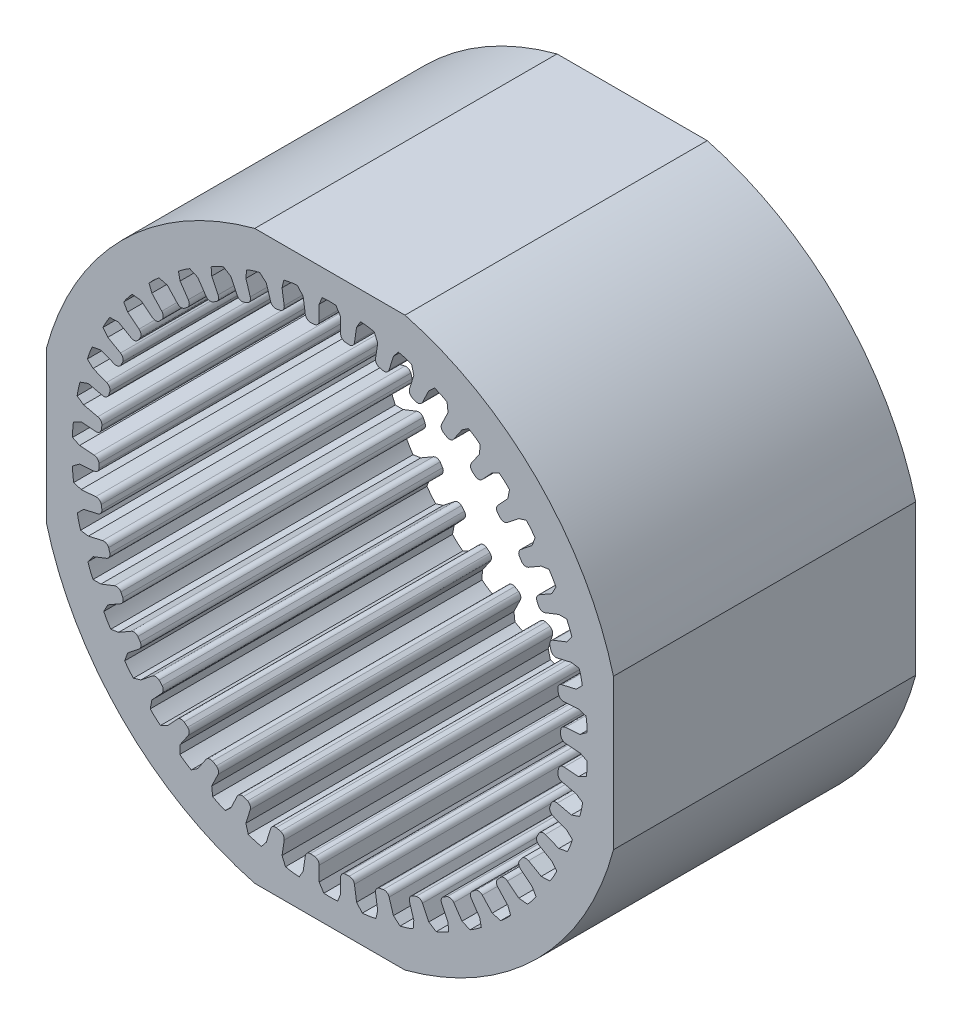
from build123d import *

# Parameters (mm, degrees)
EXTRUSION1_DEPTH        = 17
ENL_V_MAT_EXTRU_2_DEPTH = 29.24544211


with BuildPart() as part:
    # Esquisse2 → Extrusion1 (new body)
    with BuildSketch(Plane.XY):
        with BuildLine():
            Line((15.95, 4.224630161), (15.95, -4.224630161))
            ThreePointArc((15.95, -4.224630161), (11.66726189, -11.66726189), (4.224630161, -15.95))
            Line((4.224630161, -15.95), (-4.224630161, -15.95))
            ThreePointArc((-4.224630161, -15.95), (-11.66726189, -11.66726189), (-15.95, -4.224630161))
            Line((-15.95, -4.224630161), (-15.95, 4.224630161))
            ThreePointArc((-15.95, 4.224630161), (-11.66726189, 11.66726189), (-4.224630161, 15.95))
            Line((-4.224630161, 15.95), (4.224630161, 15.95))
            ThreePointArc((4.224630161, 15.95), (11.66726189, 11.66726189), (15.95, 4.224630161))
        make_face()
    extrude(amount=EXTRUSION1_DEPTH)

    # Esquisse3 → Enl_v. mat.-Extru.2 (cut, through all)
    with BuildSketch(Plane.XY.offset(17)):
        with BuildLine():
            Line((-0.437557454, 14.47958796), (-0.6, 14.07104085))
            Line((-0.6, 14.07104085), (-0.6, 13.24999998))
            ThreePointArc((-0.6, 13.24999998), (-0.66832193, 13.059408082), (-0.842168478, 12.955626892))
            Line((-0.842168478, 12.955626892), (-1.094516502, 12.939148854))
            ThreePointArc((-1.094516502, 12.939148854), (-1.28437559, 13.014582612), (-1.381912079, 13.19409127))
            Line((-1.381912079, 13.19409127), (-1.503883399, 14.003318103))
            Line((-1.503883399, 14.003318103), (-1.824603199, 14.376426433))
            ThreePointArc((-1.824603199, 14.376426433), (-2.210231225, 14.33037769), (-2.590740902, 14.252648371))
            Line((-2.590740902, 14.252648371), (-2.690478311, 13.82445359))
            Line((-2.690478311, 13.82445359), (-2.56810852, 13.012583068))
            ThreePointArc((-2.56810852, 13.012583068), (-2.607261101, 12.813937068), (-2.763698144, 12.685404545))
            Line((-2.763698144, 12.685404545), (-3.010771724, 12.631500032))
            ThreePointArc((-3.010771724, 12.631500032), (-3.209753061, 12.677794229), (-3.332954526, 12.840760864))
            Line((-3.332954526, 12.840760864), (-3.574172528, 13.62277042))
            Line((-3.574172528, 13.62277042), (-3.946919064, 13.943910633))
            ThreePointArc((-3.946919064, 13.943910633), (-4.321376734, 13.840901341), (-4.686051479, 13.70732817))
            Line((-4.686051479, 13.70732817), (-4.720855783, 13.269050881))
            Line((-4.720855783, 13.269050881), (-4.478849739, 12.484486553))
            ThreePointArc((-4.478849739, 12.484486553), (-4.487958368, 12.282223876), (-4.62349136, 12.131811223))
            Line((-4.62349136, 12.131811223), (-4.859771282, 12.041684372))
            ThreePointArc((-4.859771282, 12.041684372), (-5.063429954, 12.057804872), (-5.209544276, 12.200589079))
            Line((-5.209544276, 12.200589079), (-5.564620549, 12.937912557))
            Line((-5.564620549, 12.937912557), (-5.981067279, 13.19991091))
            ThreePointArc((-5.981067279, 13.19991091), (-6.335989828, 13.042242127), (-6.676683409, 12.855808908))
            Line((-6.676683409, 12.855808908), (-6.645777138, 12.417239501))
            Line((-6.645777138, 12.417239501), (-6.289540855, 11.677507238))
            ThreePointArc((-6.289540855, 11.677507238), (-6.268402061, 11.476146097), (-6.380003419, 11.307213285))
            Line((-6.380003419, 11.307213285), (-6.600211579, 11.182877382))
            ThreePointArc((-6.600211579, 11.182877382), (-6.803998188, 11.168464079), (-6.969761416, 11.287876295))
            Line((-6.969761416, 11.287876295), (-7.430764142, 11.964043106))
            Line((-7.430764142, 11.964043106), (-7.881608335, 12.16104699))
            ThreePointArc((-7.881608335, 12.16104699), (-8.20906738, 11.952240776), (-8.518169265, 11.717112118))
            Line((-8.518169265, 11.717112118), (-8.422242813, 11.28804751))
            Line((-8.422242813, 11.28804751), (-7.959734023, 10.609671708))
            ThreePointArc((-7.959734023, 10.609671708), (-7.908820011, 10.413710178), (-7.993996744, 10.230030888))
            Line((-7.993996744, 10.230030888), (-8.193214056, 10.07426339))
            ThreePointArc((-8.193214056, 10.07426339), (-8.392576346, 10.029638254), (-8.574285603, 10.123011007))
            Line((-8.574285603, 10.123011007), (-9.130916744, 10.722916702))
            Line((-9.130916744, 10.722916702), (-9.606087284, 10.850525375))
            ThreePointArc((-9.606087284, 10.850525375), (-9.898767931, 10.595246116), (-10.169373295, 10.316674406))
            Line((-10.169373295, 10.316674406), (-10.010569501, 9.906699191))
            Line((-10.010569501, 9.906699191), (-9.452119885, 9.304833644))
            ThreePointArc((-9.452119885, 9.304833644), (-9.37256799, 9.118649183), (-9.429417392, 8.924326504))
            Line((-9.429417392, 8.924326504), (-9.603193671, 8.740607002))
            ThreePointArc((-9.603193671, 8.740607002), (-9.793678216, 8.666766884), (-9.987274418, 8.73201438))
            Line((-9.987274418, 8.73201438), (-10.627099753, 9.242258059))
            Line((-10.627099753, 9.242258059), (-11.115982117, 9.297620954))
            ThreePointArc((-11.115982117, 9.297620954), (-11.367346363, 9.001571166), (-11.593410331, 8.685779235))
            Line((-11.593410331, 8.685779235), (-11.375276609, 8.304051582))
            Line((-11.375276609, 8.304051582), (-10.733361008, 7.792140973))
            ThreePointArc((-10.733361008, 7.792140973), (-10.626948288, 7.619892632), (-10.654200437, 7.419267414))
            Line((-10.654200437, 7.419267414), (-10.798653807, 7.211699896))
            ThreePointArc((-10.798653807, 7.211699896), (-10.976005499, 7.110294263), (-11.177164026, 7.145958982))
            Line((-11.177164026, 7.145958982), (-11.885890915, 7.555142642))
            Line((-11.885890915, 7.555142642), (-12.377564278, 7.537023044))
            ThreePointArc((-12.377564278, 7.537023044), (-12.581997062, 7.206815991), (-12.758469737, 6.860858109))
            Line((-12.758469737, 6.860858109), (-12.485878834, 6.515905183))
            Line((-12.485878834, 6.515905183), (-11.774836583, 6.105384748))
            ThreePointArc((-11.774836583, 6.105384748), (-11.643940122, 5.950920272), (-11.640986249, 5.74847415))
            Line((-11.640986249, 5.74847415), (-11.752889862, 5.521695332))
            ThreePointArc((-11.752889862, 5.521695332), (-11.913146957, 5.394989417), (-12.117374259, 5.400274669))
            Line((-12.117374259, 5.400274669), (-12.879170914, 5.699257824))
            Line((-12.879170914, 5.699257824), (-13.362652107, 5.608060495))
            ThreePointArc((-13.362652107, 5.608060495), (-13.515586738, 5.251072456), (-13.638526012, 4.88267675))
            Line((-13.638526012, 4.88267675), (-13.317567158, 4.582204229))
            Line((-13.317567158, 4.582204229), (-12.553281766, 4.282244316))
            ThreePointArc((-12.553281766, 4.282244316), (-12.400825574, 4.149014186), (-12.367731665, 3.949269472))
            Line((-12.367731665, 3.949269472), (-12.444585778, 3.708345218))
            ThreePointArc((-12.444585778, 3.708345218), (-12.584168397, 3.559169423), (-12.786902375, 3.533957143))
            Line((-12.786902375, 3.533957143), (-13.584751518, 3.716061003))
            Line((-13.584751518, 3.716061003), (-14.049240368, 3.55382314))
            ThreePointArc((-14.049240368, 3.55382314), (-14.147260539, 3.178028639), (-14.213920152, 2.795424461))
            Line((-14.213920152, 2.795424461), (-13.851763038, 2.546144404))
            Line((-13.851763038, 2.546144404), (-13.051307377, 2.363445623))
            ThreePointArc((-13.051307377, 2.363445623), (-12.880697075, 2.25442598), (-12.818202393, 2.06184464))
            Line((-12.818202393, 2.06184464), (-12.858290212, 1.8121568))
            ThreePointArc((-12.858290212, 1.8121568), (-12.97408031, 1.643843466), (-13.170792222, 1.588696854))
            Line((-13.170792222, 1.588696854), (-13.986871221, 1.64985352))
            Line((-13.986871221, 1.64985352), (-14.421991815, 1.42019925))
            ThreePointArc((-14.421991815, 1.42019925), (-14.462907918, 1.033992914), (-14.471798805, 0.645727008))
            Line((-14.471798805, 0.645727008), (-14.076533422, 0.453207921))
            Line((-14.076533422, 0.453207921), (-13.257788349, 0.39185146))
            ThreePointArc((-13.257788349, 0.39185146), (-13.072835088, 0.309477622), (-12.982335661, 0.128361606))
            Line((-12.982335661, 0.128361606), (-12.98476169, -0.124512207))
            ThreePointArc((-12.98476169, -0.124512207), (-13.074172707, -0.308203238), (-13.260468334, -0.392052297))
            Line((-13.260468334, -0.392052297), (-14.076547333, -0.453208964))
            Line((-14.076547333, -0.453208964), (-14.472579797, -0.745149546))
            ThreePointArc((-14.472579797, -0.745149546), (-14.455477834, -1.133140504), (-14.406401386, -1.518394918))
            Line((-14.406401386, -1.518394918), (-13.98685731, -1.649852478))
            Line((-13.98685731, -1.649852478), (-13.168112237, -1.588496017))
            ThreePointArc((-13.168112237, -1.588496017), (-12.972947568, -1.642383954), (-12.856465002, -1.807988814))
            Line((-12.856465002, -1.807988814), (-12.821175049, -2.058399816))
            ThreePointArc((-12.821175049, -2.058399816), (-12.882209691, -2.253365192), (-13.053927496, -2.364043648))
            Line((-13.053927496, -2.364043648), (-13.851776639, -2.546147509))
            Line((-13.851776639, -2.546147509), (-14.199874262, -2.893852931))
            ThreePointArc((-14.199874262, -2.893852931), (-14.125136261, -3.274961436), (-14.019188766, -3.648598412))
            Line((-14.019188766, -3.648598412), (-13.584737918, -3.716057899))
            Line((-13.584737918, -3.716057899), (-12.784282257, -3.533359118))
            ThreePointArc((-12.784282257, -3.533359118), (-12.583265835, -3.557557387), (-12.44340216, -3.703951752))
            Line((-12.44340216, -3.703951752), (-12.371184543, -3.946306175))
            ThreePointArc((-12.371184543, -3.946306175), (-12.402479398, -4.14819069), (-12.555783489, -4.28322617))
            Line((-12.555783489, -4.28322617), (-13.317580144, -4.582209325))
            Line((-13.317580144, -4.582209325), (-13.609966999, -4.977912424))
            ThreePointArc((-13.609966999, -4.977912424), (-13.479262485, -5.343625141), (-13.318810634, -5.697298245))
            Line((-13.318810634, -5.697298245), (-12.879157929, -5.699252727))
            Line((-12.879157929, -5.699252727), (-12.114872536, -5.399292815))
            ThreePointArc((-12.114872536, -5.399292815), (-11.912494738, -5.393260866), (-11.752374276, -5.517174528))
            Line((-11.752374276, -5.517174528), (-11.644842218, -5.746058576))
            ThreePointArc((-11.644842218, -5.746058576), (-11.64569821, -5.950352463), (-11.777164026, -6.106728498))
            Line((-11.777164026, -6.106728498), (-12.485890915, -6.515912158))
            Line((-12.485890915, -6.515912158), (-12.716035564, -6.95077358))
            ThreePointArc((-12.716035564, -6.95077358), (-12.53228426, -7.292921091), (-12.320912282, -7.618729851))
            Line((-12.320912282, -7.618729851), (-11.885878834, -7.555135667))
            Line((-11.885878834, -7.555135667), (-11.174836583, -7.144615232))
            ThreePointArc((-11.174836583, -7.144615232), (-10.975618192, -7.10848781), (-10.798817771, -7.207152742))
            Line((-10.798817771, -7.207152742), (-10.65837336, -7.417453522))
            ThreePointArc((-10.65837336, -7.417453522), (-10.628771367, -7.619593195), (-10.73546218, -7.793816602))
            Line((-10.73546218, -7.793816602), (-11.375287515, -8.30406028))
            Line((-11.375287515, -8.30406028), (-11.538048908, -8.768365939))
            ThreePointArc((-11.538048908, -8.768365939), (-11.305355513, -9.079305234), (-11.04778511, -9.369971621))
            Line((-11.04778511, -9.369971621), (-10.627088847, -9.242249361))
            Line((-10.627088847, -9.242249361), (-9.985173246, -8.730338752))
            ThreePointArc((-9.985173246, -8.730338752), (-9.793564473, -8.664922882), (-9.604033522, -8.736135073))
            Line((-9.604033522, -8.736135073), (-9.433814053, -8.923154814))
            ThreePointArc((-9.433814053, -8.923154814), (-9.374415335, -9.118624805), (-9.453947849, -9.306803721))
            Line((-9.453947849, -9.306803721), (-10.01057899, -9.906709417))
            Line((-10.01057899, -9.906709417), (-10.102321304, -10.390087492))
            ThreePointArc((-10.102321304, -10.390087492), (-9.825883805, -10.662872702), (-9.527868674, -10.911903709))
            Line((-9.527868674, -10.911903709), (-9.130907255, -10.722906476))
            Line((-9.130907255, -10.722906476), (-8.572457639, -10.12104093))
            ThreePointArc((-8.572457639, -10.12104093), (-8.392738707, -10.027797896), (-8.194711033, -10.069966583))
            Line((-8.194711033, -10.069966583), (-7.99851893, -10.229527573))
            ThreePointArc((-7.99851893, -10.229527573), (-7.910650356, -10.413961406), (-7.961247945, -10.611892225))
            Line((-7.961247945, -10.611892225), (-8.422250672, -11.288059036))
            Line((-8.422250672, -11.288059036), (-8.440924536, -11.779711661))
            ThreePointArc((-8.440924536, -11.779711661), (-8.12691809, -12.008249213), (-7.795115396, -12.210081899))
            Line((-7.795115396, -12.210081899), (-7.430756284, -11.96403158))
            Line((-7.430756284, -11.96403158), (-6.968247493, -11.285655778))
            ThreePointArc((-6.968247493, -11.285655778), (-6.804433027, -11.166668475), (-6.602332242, -11.17885168))
            Line((-6.602332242, -11.17885168), (-6.384550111, -11.307389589))
            ThreePointArc((-6.384550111, -11.307389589), (-6.27017452, -11.476667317), (-6.290706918, -11.679928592))
            Line((-6.290706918, -11.679928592), (-6.645783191, -12.41725207))
            Line((-6.645783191, -12.41725207), (-6.590971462, -12.906196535))
            ThreePointArc((-6.590971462, -12.906196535), (-6.246410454, -13.08538128), (-5.888232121, -13.235507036))
            Line((-5.888232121, -13.235507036), (-5.564614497, -12.937899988))
            Line((-5.564614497, -12.937899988), (-5.208378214, -12.198167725))
            ThreePointArc((-5.208378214, -12.198167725), (-5.064127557, -12.056094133), (-4.862468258, -12.038019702))
            Line((-4.862468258, -12.038019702), (-4.627960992, -12.132663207))
            ThreePointArc((-4.627960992, -12.132663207), (-4.489633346, -12.283003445), (-4.479641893, -12.487054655))
            Line((-4.479641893, -12.487054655), (-4.720859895, -13.269064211))
            Line((-4.720859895, -13.269064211), (-4.593786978, -13.744378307))
            ThreePointArc((-4.593786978, -13.744378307), (-4.22636833, -13.870207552), (-3.84981547, -13.965272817))
            Line((-3.84981547, -13.965272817), (-3.574168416, -13.62275709))
            Line((-3.574168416, -13.62275709), (-3.332162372, -12.838192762))
            ThreePointArc((-3.332162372, -12.838192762), (-3.210697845, -12.676206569), (-3.013984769, -12.628278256))
            Line((-3.013984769, -12.628278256), (-2.767990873, -12.686913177))
            ThreePointArc((-2.767990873, -12.686913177), (-2.608801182, -12.814957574), (-2.568509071, -13.015240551))
            Line((-2.568509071, -13.015240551), (-2.690480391, -13.824467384))
            Line((-2.690480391, -13.824467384), (-2.493984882, -14.275533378))
            ThreePointArc((-2.493984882, -14.275533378), (-2.111916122, -14.345196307), (-1.725400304, -14.38307748))
            Line((-1.725400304, -14.38307748), (-1.50388132, -14.003304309))
            Line((-1.50388132, -14.003304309), (-1.381511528, -13.191433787))
            ThreePointArc((-1.381511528, -13.191433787), (-1.28554645, -13.013153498), (-1.09817384, -12.936441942))
            Line((-1.09817384, -12.936441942), (-0.846188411, -12.957758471))
            ThreePointArc((-0.846188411, -12.957758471), (-0.66969271, -13.060646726), (-0.6, -13.25268748))
            Line((-0.6, -13.25268748), (-0.6, -14.0710548))
            Line((-0.6, -14.0710548), (-0.338471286, -14.487796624))
            ThreePointArc((-0.338471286, -14.487796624), (0.049712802, -14.499737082), (0.437557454, -14.47958796))
            Line((0.437557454, -14.47958796), (0.6, -14.07104085))
            Line((0.6, -14.07104085), (0.6, -13.24999998))
            ThreePointArc((0.6, -13.24999998), (0.66832193, -13.059408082), (0.842168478, -12.955626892))
            Line((0.842168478, -12.955626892), (1.094516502, -12.939148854))
            ThreePointArc((1.094516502, -12.939148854), (1.28437559, -13.014582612), (1.381912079, -13.19409127))
            Line((1.381912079, -13.19409127), (1.503883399, -14.003318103))
            Line((1.503883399, -14.003318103), (1.824603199, -14.376426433))
            ThreePointArc((1.824603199, -14.376426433), (2.210231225, -14.33037769), (2.590740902, -14.252648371))
            Line((2.590740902, -14.252648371), (2.690478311, -13.82445359))
            Line((2.690478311, -13.82445359), (2.56810852, -13.012583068))
            ThreePointArc((2.56810852, -13.012583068), (2.607261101, -12.813937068), (2.763698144, -12.685404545))
            Line((2.763698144, -12.685404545), (3.010771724, -12.631500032))
            ThreePointArc((3.010771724, -12.631500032), (3.209753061, -12.677794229), (3.332954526, -12.840760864))
            Line((3.332954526, -12.840760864), (3.574172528, -13.62277042))
            Line((3.574172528, -13.62277042), (3.946919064, -13.943910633))
            ThreePointArc((3.946919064, -13.943910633), (4.321376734, -13.840901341), (4.686051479, -13.70732817))
            Line((4.686051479, -13.70732817), (4.720855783, -13.269050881))
            Line((4.720855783, -13.269050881), (4.478849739, -12.484486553))
            ThreePointArc((4.478849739, -12.484486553), (4.487958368, -12.282223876), (4.62349136, -12.131811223))
            Line((4.62349136, -12.131811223), (4.859771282, -12.041684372))
            ThreePointArc((4.859771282, -12.041684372), (5.063429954, -12.057804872), (5.209544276, -12.200589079))
            Line((5.209544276, -12.200589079), (5.564620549, -12.937912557))
            Line((5.564620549, -12.937912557), (5.981067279, -13.19991091))
            ThreePointArc((5.981067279, -13.19991091), (6.335989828, -13.042242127), (6.676683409, -12.855808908))
            Line((6.676683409, -12.855808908), (6.645777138, -12.417239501))
            Line((6.645777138, -12.417239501), (6.289540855, -11.677507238))
            ThreePointArc((6.289540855, -11.677507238), (6.268402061, -11.476146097), (6.380003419, -11.307213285))
            Line((6.380003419, -11.307213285), (6.600211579, -11.182877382))
            ThreePointArc((6.600211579, -11.182877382), (6.803998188, -11.168464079), (6.969761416, -11.287876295))
            Line((6.969761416, -11.287876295), (7.430764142, -11.964043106))
            Line((7.430764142, -11.964043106), (7.881608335, -12.16104699))
            ThreePointArc((7.881608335, -12.16104699), (8.20906738, -11.952240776), (8.518169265, -11.717112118))
            Line((8.518169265, -11.717112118), (8.422242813, -11.28804751))
            Line((8.422242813, -11.28804751), (7.959734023, -10.609671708))
            ThreePointArc((7.959734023, -10.609671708), (7.908820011, -10.413710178), (7.993996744, -10.230030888))
            Line((7.993996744, -10.230030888), (8.193214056, -10.07426339))
            ThreePointArc((8.193214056, -10.07426339), (8.392576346, -10.029638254), (8.574285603, -10.123011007))
            Line((8.574285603, -10.123011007), (9.130916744, -10.722916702))
            Line((9.130916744, -10.722916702), (9.606087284, -10.850525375))
            ThreePointArc((9.606087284, -10.850525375), (9.898767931, -10.595246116), (10.169373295, -10.316674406))
            Line((10.169373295, -10.316674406), (10.010569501, -9.906699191))
            Line((10.010569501, -9.906699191), (9.452119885, -9.304833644))
            ThreePointArc((9.452119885, -9.304833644), (9.37256799, -9.118649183), (9.429417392, -8.924326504))
            Line((9.429417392, -8.924326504), (9.603193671, -8.740607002))
            ThreePointArc((9.603193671, -8.740607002), (9.793678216, -8.666766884), (9.987274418, -8.73201438))
            Line((9.987274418, -8.73201438), (10.627099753, -9.242258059))
            Line((10.627099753, -9.242258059), (11.115982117, -9.297620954))
            ThreePointArc((11.115982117, -9.297620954), (11.367346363, -9.001571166), (11.593410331, -8.685779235))
            Line((11.593410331, -8.685779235), (11.375276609, -8.304051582))
            Line((11.375276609, -8.304051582), (10.733361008, -7.792140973))
            ThreePointArc((10.733361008, -7.792140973), (10.626948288, -7.619892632), (10.654200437, -7.419267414))
            Line((10.654200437, -7.419267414), (10.798653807, -7.211699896))
            ThreePointArc((10.798653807, -7.211699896), (10.976005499, -7.110294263), (11.177164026, -7.145958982))
            Line((11.177164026, -7.145958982), (11.885890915, -7.555142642))
            Line((11.885890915, -7.555142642), (12.377564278, -7.537023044))
            ThreePointArc((12.377564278, -7.537023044), (12.581997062, -7.206815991), (12.758469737, -6.860858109))
            Line((12.758469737, -6.860858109), (12.485878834, -6.515905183))
            Line((12.485878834, -6.515905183), (11.774836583, -6.105384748))
            ThreePointArc((11.774836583, -6.105384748), (11.643940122, -5.950920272), (11.640986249, -5.74847415))
            Line((11.640986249, -5.74847415), (11.752889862, -5.521695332))
            ThreePointArc((11.752889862, -5.521695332), (11.913146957, -5.394989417), (12.117374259, -5.400274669))
            Line((12.117374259, -5.400274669), (12.879170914, -5.699257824))
            Line((12.879170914, -5.699257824), (13.362652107, -5.608060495))
            ThreePointArc((13.362652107, -5.608060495), (13.515586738, -5.251072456), (13.638526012, -4.88267675))
            Line((13.638526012, -4.88267675), (13.317567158, -4.582204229))
            Line((13.317567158, -4.582204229), (12.553281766, -4.282244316))
            ThreePointArc((12.553281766, -4.282244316), (12.400825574, -4.149014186), (12.367731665, -3.949269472))
            Line((12.367731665, -3.949269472), (12.444585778, -3.708345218))
            ThreePointArc((12.444585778, -3.708345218), (12.584168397, -3.559169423), (12.786902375, -3.533957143))
            Line((12.786902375, -3.533957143), (13.584751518, -3.716061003))
            Line((13.584751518, -3.716061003), (14.049240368, -3.55382314))
            ThreePointArc((14.049240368, -3.55382314), (14.147260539, -3.178028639), (14.213920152, -2.795424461))
            Line((14.213920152, -2.795424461), (13.851763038, -2.546144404))
            Line((13.851763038, -2.546144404), (13.051307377, -2.363445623))
            ThreePointArc((13.051307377, -2.363445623), (12.880697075, -2.25442598), (12.818202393, -2.06184464))
            Line((12.818202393, -2.06184464), (12.858290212, -1.8121568))
            ThreePointArc((12.858290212, -1.8121568), (12.97408031, -1.643843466), (13.170792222, -1.588696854))
            Line((13.170792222, -1.588696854), (13.986871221, -1.64985352))
            Line((13.986871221, -1.64985352), (14.421991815, -1.42019925))
            ThreePointArc((14.421991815, -1.42019925), (14.462907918, -1.033992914), (14.471798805, -0.645727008))
            Line((14.471798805, -0.645727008), (14.076533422, -0.453207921))
            Line((14.076533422, -0.453207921), (13.257788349, -0.39185146))
            ThreePointArc((13.257788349, -0.39185146), (13.072835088, -0.309477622), (12.982335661, -0.128361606))
            Line((12.982335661, -0.128361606), (12.98476169, 0.124512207))
            ThreePointArc((12.98476169, 0.124512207), (13.074172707, 0.308203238), (13.260468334, 0.392052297))
            Line((13.260468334, 0.392052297), (14.076547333, 0.453208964))
            Line((14.076547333, 0.453208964), (14.472579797, 0.745149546))
            ThreePointArc((14.472579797, 0.745149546), (14.455477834, 1.133140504), (14.406401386, 1.518394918))
            Line((14.406401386, 1.518394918), (13.98685731, 1.649852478))
            Line((13.98685731, 1.649852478), (13.168112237, 1.588496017))
            ThreePointArc((13.168112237, 1.588496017), (12.972947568, 1.642383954), (12.856465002, 1.807988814))
            Line((12.856465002, 1.807988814), (12.821175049, 2.058399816))
            ThreePointArc((12.821175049, 2.058399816), (12.882209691, 2.253365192), (13.053927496, 2.364043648))
            Line((13.053927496, 2.364043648), (13.851776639, 2.546147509))
            Line((13.851776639, 2.546147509), (14.199874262, 2.893852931))
            ThreePointArc((14.199874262, 2.893852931), (14.125136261, 3.274961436), (14.019188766, 3.648598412))
            Line((14.019188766, 3.648598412), (13.584737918, 3.716057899))
            Line((13.584737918, 3.716057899), (12.784282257, 3.533359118))
            ThreePointArc((12.784282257, 3.533359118), (12.583265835, 3.557557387), (12.44340216, 3.703951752))
            Line((12.44340216, 3.703951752), (12.371184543, 3.946306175))
            ThreePointArc((12.371184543, 3.946306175), (12.402479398, 4.14819069), (12.555783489, 4.28322617))
            Line((12.555783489, 4.28322617), (13.317580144, 4.582209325))
            Line((13.317580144, 4.582209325), (13.609966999, 4.977912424))
            ThreePointArc((13.609966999, 4.977912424), (13.479262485, 5.343625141), (13.318810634, 5.697298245))
            Line((13.318810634, 5.697298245), (12.879157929, 5.699252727))
            Line((12.879157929, 5.699252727), (12.114872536, 5.399292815))
            ThreePointArc((12.114872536, 5.399292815), (11.912494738, 5.393260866), (11.752374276, 5.517174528))
            Line((11.752374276, 5.517174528), (11.644842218, 5.746058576))
            ThreePointArc((11.644842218, 5.746058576), (11.64569821, 5.950352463), (11.777164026, 6.106728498))
            Line((11.777164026, 6.106728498), (12.485890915, 6.515912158))
            Line((12.485890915, 6.515912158), (12.716035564, 6.95077358))
            ThreePointArc((12.716035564, 6.95077358), (12.53228426, 7.292921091), (12.320912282, 7.618729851))
            Line((12.320912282, 7.618729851), (11.885878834, 7.555135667))
            Line((11.885878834, 7.555135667), (11.174836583, 7.144615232))
            ThreePointArc((11.174836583, 7.144615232), (10.975618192, 7.10848781), (10.798817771, 7.207152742))
            Line((10.798817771, 7.207152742), (10.65837336, 7.417453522))
            ThreePointArc((10.65837336, 7.417453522), (10.628771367, 7.619593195), (10.73546218, 7.793816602))
            Line((10.73546218, 7.793816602), (11.375287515, 8.30406028))
            Line((11.375287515, 8.30406028), (11.538048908, 8.768365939))
            ThreePointArc((11.538048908, 8.768365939), (11.305355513, 9.079305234), (11.04778511, 9.369971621))
            Line((11.04778511, 9.369971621), (10.627088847, 9.242249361))
            Line((10.627088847, 9.242249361), (9.985173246, 8.730338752))
            ThreePointArc((9.985173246, 8.730338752), (9.793564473, 8.664922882), (9.604033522, 8.736135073))
            Line((9.604033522, 8.736135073), (9.433814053, 8.923154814))
            ThreePointArc((9.433814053, 8.923154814), (9.374415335, 9.118624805), (9.453947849, 9.306803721))
            Line((9.453947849, 9.306803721), (10.01057899, 9.906709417))
            Line((10.01057899, 9.906709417), (10.102321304, 10.390087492))
            ThreePointArc((10.102321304, 10.390087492), (9.825883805, 10.662872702), (9.527868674, 10.911903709))
            Line((9.527868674, 10.911903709), (9.130907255, 10.722906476))
            Line((9.130907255, 10.722906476), (8.572457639, 10.12104093))
            ThreePointArc((8.572457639, 10.12104093), (8.392738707, 10.027797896), (8.194711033, 10.069966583))
            Line((8.194711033, 10.069966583), (7.99851893, 10.229527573))
            ThreePointArc((7.99851893, 10.229527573), (7.910650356, 10.413961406), (7.961247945, 10.611892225))
            Line((7.961247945, 10.611892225), (8.422250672, 11.288059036))
            Line((8.422250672, 11.288059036), (8.440924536, 11.779711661))
            ThreePointArc((8.440924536, 11.779711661), (8.12691809, 12.008249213), (7.795115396, 12.210081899))
            Line((7.795115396, 12.210081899), (7.430756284, 11.96403158))
            Line((7.430756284, 11.96403158), (6.968247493, 11.285655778))
            ThreePointArc((6.968247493, 11.285655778), (6.804433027, 11.166668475), (6.602332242, 11.17885168))
            Line((6.602332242, 11.17885168), (6.384550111, 11.307389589))
            ThreePointArc((6.384550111, 11.307389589), (6.27017452, 11.476667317), (6.290706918, 11.679928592))
            Line((6.290706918, 11.679928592), (6.645783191, 12.41725207))
            Line((6.645783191, 12.41725207), (6.590971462, 12.906196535))
            ThreePointArc((6.590971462, 12.906196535), (6.246410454, 13.08538128), (5.888232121, 13.235507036))
            Line((5.888232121, 13.235507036), (5.564614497, 12.937899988))
            Line((5.564614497, 12.937899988), (5.208378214, 12.198167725))
            ThreePointArc((5.208378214, 12.198167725), (5.064127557, 12.056094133), (4.862468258, 12.038019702))
            Line((4.862468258, 12.038019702), (4.627960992, 12.132663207))
            ThreePointArc((4.627960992, 12.132663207), (4.489633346, 12.283003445), (4.479641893, 12.487054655))
            Line((4.479641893, 12.487054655), (4.720859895, 13.269064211))
            Line((4.720859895, 13.269064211), (4.593786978, 13.744378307))
            ThreePointArc((4.593786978, 13.744378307), (4.22636833, 13.870207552), (3.84981547, 13.965272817))
            Line((3.84981547, 13.965272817), (3.574168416, 13.62275709))
            Line((3.574168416, 13.62275709), (3.332162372, 12.838192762))
            ThreePointArc((3.332162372, 12.838192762), (3.210697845, 12.676206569), (3.013984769, 12.628278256))
            Line((3.013984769, 12.628278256), (2.767990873, 12.686913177))
            ThreePointArc((2.767990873, 12.686913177), (2.608801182, 12.814957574), (2.568509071, 13.015240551))
            Line((2.568509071, 13.015240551), (2.690480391, 13.824467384))
            Line((2.690480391, 13.824467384), (2.493984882, 14.275533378))
            ThreePointArc((2.493984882, 14.275533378), (2.111916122, 14.345196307), (1.725400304, 14.38307748))
            Line((1.725400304, 14.38307748), (1.50388132, 14.003304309))
            Line((1.50388132, 14.003304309), (1.381511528, 13.191433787))
            ThreePointArc((1.381511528, 13.191433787), (1.28554645, 13.013153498), (1.09817384, 12.936441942))
            Line((1.09817384, 12.936441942), (0.846188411, 12.957758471))
            ThreePointArc((0.846188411, 12.957758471), (0.66969271, 13.060646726), (0.6, 13.25268748))
            Line((0.6, 13.25268748), (0.6, 14.0710548))
            Line((0.6, 14.0710548), (0.338471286, 14.487796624))
            ThreePointArc((0.338471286, 14.487796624), (-0.049712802, 14.499737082), (-0.437557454, 14.47958796))
        make_face()
    extrude(amount=-ENL_V_MAT_EXTRU_2_DEPTH, mode=Mode.SUBTRACT)


solid = part.part
